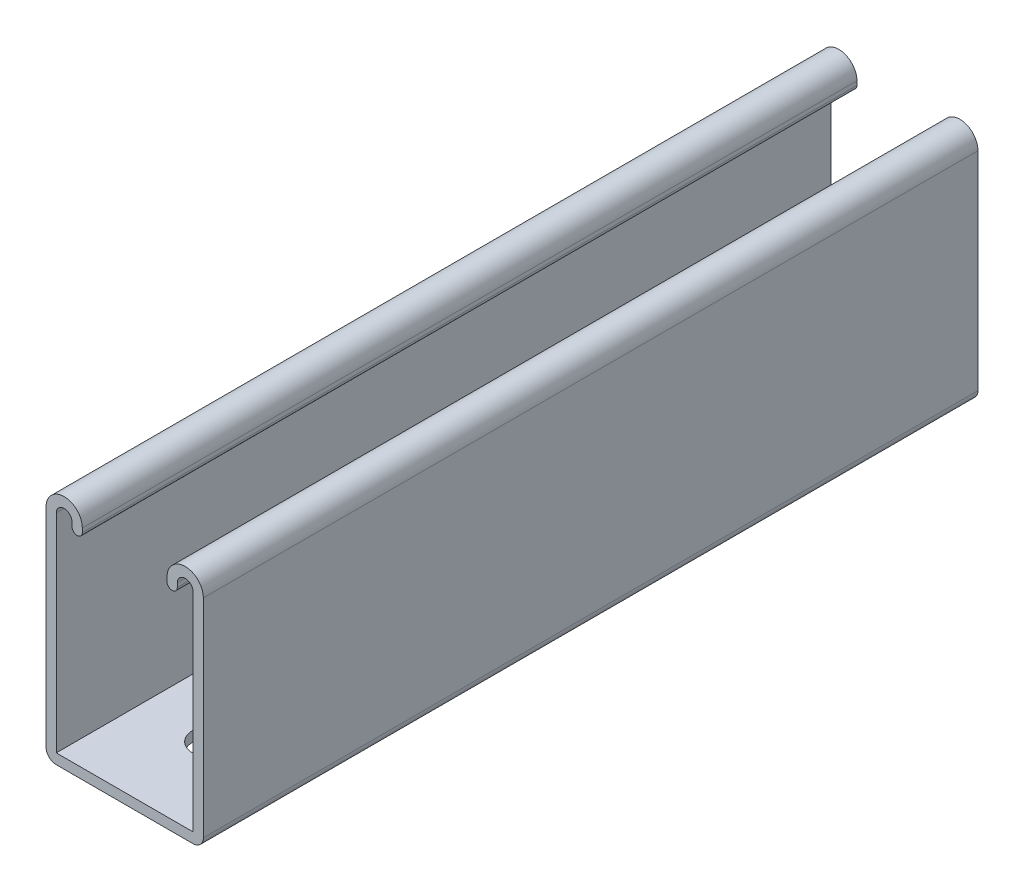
ISO-10303-21;
HEADER;
FILE_DESCRIPTION(('STEP AP214'),'2;1');
FILE_NAME('part.step','',(''),(''),'','','');
FILE_SCHEMA(('AUTOMOTIVE_DESIGN { 1 0 10303 214 1 1 1 1 }'));
ENDSEC;
DATA;
#1=APPLICATION_CONTEXT('core data for automotive mechanical design processes');
#2=APPLICATION_PROTOCOL_DEFINITION('international standard','automotive_design',2000,#1);
#3=PRODUCT_CONTEXT('',#1,'mechanical');
#4=PRODUCT('Part','Part','',(#3));
#5=PRODUCT_RELATED_PRODUCT_CATEGORY('part','',(#4));
#6=PRODUCT_DEFINITION_FORMATION('','',#4);
#7=PRODUCT_DEFINITION_CONTEXT('part definition',#1,'design');
#8=PRODUCT_DEFINITION('design','',#6,#7);
#9=PRODUCT_DEFINITION_SHAPE('','',#8);
#10=(LENGTH_UNIT() NAMED_UNIT(*) SI_UNIT(.MILLI.,.METRE.));
#11=(NAMED_UNIT(*) PLANE_ANGLE_UNIT() SI_UNIT($,.RADIAN.));
#12=(NAMED_UNIT(*) SI_UNIT($,.STERADIAN.) SOLID_ANGLE_UNIT());
#13=UNCERTAINTY_MEASURE_WITH_UNIT(LENGTH_MEASURE(1.E-05),#10,'distance_accuracy_value','');
#14=(GEOMETRIC_REPRESENTATION_CONTEXT(3) GLOBAL_UNCERTAINTY_ASSIGNED_CONTEXT((#13)) GLOBAL_UNIT_ASSIGNED_CONTEXT((#10,
#11,#12)) REPRESENTATION_CONTEXT('',''));
#15=CARTESIAN_POINT('',(0.,0.,0.));
#16=DIRECTION('',(0.,0.,1.));
#17=DIRECTION('',(1.,0.,0.));
#18=AXIS2_PLACEMENT_3D('',#15,#16,#17);
#19=CARTESIAN_POINT('',(-15.875,29.1719,203.2));
#20=DIRECTION('',(0.,0.,-1.));
#21=DIRECTION('',(-1.,0.,0.));
#22=AXIS2_PLACEMENT_3D('',#19,#20,#21);
#23=CYLINDRICAL_SURFACE('',#22,4.7625);
#24=CARTESIAN_POINT('',(-15.875,29.1719,0.));
#25=DIRECTION('',(0.,0.,1.));
#26=DIRECTION('',(-1.,0.,0.));
#27=AXIS2_PLACEMENT_3D('',#24,#25,#26);
#28=CIRCLE('',#27,4.7625);
#29=CARTESIAN_POINT('',(-11.1125,29.1719,0.));
#30=VERTEX_POINT('',#29);
#31=CARTESIAN_POINT('',(-20.6375,29.1719,0.));
#32=VERTEX_POINT('',#31);
#33=EDGE_CURVE('E278',#30,#32,#28,.T.);
#34=ORIENTED_EDGE('',*,*,#33,.T.);
#35=DIRECTION('',(0.,0.,-1.));
#36=VECTOR('',#35,1.);
#37=CARTESIAN_POINT('',(-20.6375,29.1719,203.2));
#38=LINE('',#37,#36);
#39=CARTESIAN_POINT('',(-20.6375,29.1719,203.2));
#40=VERTEX_POINT('',#39);
#41=EDGE_CURVE('E467',#40,#32,#38,.T.);
#42=ORIENTED_EDGE('',*,*,#41,.F.);
#43=CARTESIAN_POINT('',(-15.875,29.1719,203.2));
#44=DIRECTION('',(0.,0.,1.));
#45=DIRECTION('',(-1.,0.,0.));
#46=AXIS2_PLACEMENT_3D('',#43,#44,#45);
#47=CIRCLE('',#46,4.7625);
#48=CARTESIAN_POINT('',(-11.1125,29.1719,203.2));
#49=VERTEX_POINT('',#48);
#50=EDGE_CURVE('E286',#49,#40,#47,.T.);
#51=ORIENTED_EDGE('',*,*,#50,.F.);
#52=DIRECTION('',(0.,0.,-1.));
#53=VECTOR('',#52,1.);
#54=CARTESIAN_POINT('',(-11.1125,29.1719,203.2));
#55=LINE('',#54,#53);
#56=EDGE_CURVE('E344',#49,#30,#55,.T.);
#57=ORIENTED_EDGE('',*,*,#56,.T.);
#58=EDGE_LOOP('',(#34,#42,#51,#57));
#59=FACE_BOUND('',#58,.T.);
#60=ADVANCED_FACE('F41',(#59),#23,.T.);
#61=CARTESIAN_POINT('',(-20.6375,29.1719,203.2));
#62=DIRECTION('',(1.,0.,0.));
#63=DIRECTION('',(0.,1.,0.));
#64=AXIS2_PLACEMENT_3D('',#61,#62,#63);
#65=PLANE('',#64);
#66=DIRECTION('',(0.,-1.,0.));
#67=VECTOR('',#66,1.);
#68=CARTESIAN_POINT('',(-20.6375,29.1719,0.));
#69=LINE('',#68,#67);
#70=CARTESIAN_POINT('',(-20.6375,-25.3238,0.));
#71=VERTEX_POINT('',#70);
#72=EDGE_CURVE('E347',#32,#71,#69,.T.);
#73=ORIENTED_EDGE('',*,*,#72,.T.);
#74=DIRECTION('',(0.,0.,-1.));
#75=VECTOR('',#74,1.);
#76=CARTESIAN_POINT('',(-20.6375,-25.3238,203.2));
#77=LINE('',#76,#75);
#78=CARTESIAN_POINT('',(-20.6375,-25.3238,203.2));
#79=VERTEX_POINT('',#78);
#80=EDGE_CURVE('E464',#79,#71,#77,.T.);
#81=ORIENTED_EDGE('',*,*,#80,.F.);
#82=DIRECTION('',(0.,-1.,0.));
#83=VECTOR('',#82,1.);
#84=CARTESIAN_POINT('',(-20.6375,29.1719,203.2));
#85=LINE('',#84,#83);
#86=EDGE_CURVE('E291',#40,#79,#85,.T.);
#87=ORIENTED_EDGE('',*,*,#86,.F.);
#88=ORIENTED_EDGE('',*,*,#41,.T.);
#89=EDGE_LOOP('',(#73,#81,#87,#88));
#90=FACE_BOUND('',#89,.T.);
#91=ADVANCED_FACE('F514',(#90),#65,.F.);
#92=CARTESIAN_POINT('',(-17.9451,-25.3238,203.2));
#93=DIRECTION('',(0.,0.,-1.));
#94=DIRECTION('',(-1.,0.,0.));
#95=AXIS2_PLACEMENT_3D('',#92,#93,#94);
#96=CYLINDRICAL_SURFACE('',#95,2.6924);
#97=CARTESIAN_POINT('',(-17.9451,-25.3238,0.));
#98=DIRECTION('',(0.,0.,1.));
#99=DIRECTION('',(-1.,0.,0.));
#100=AXIS2_PLACEMENT_3D('',#97,#98,#99);
#101=CIRCLE('',#100,2.6924);
#102=CARTESIAN_POINT('',(-17.9451,-28.0162,0.));
#103=VERTEX_POINT('',#102);
#104=EDGE_CURVE('E354',#71,#103,#101,.T.);
#105=ORIENTED_EDGE('',*,*,#104,.T.);
#106=DIRECTION('',(0.,0.,-1.));
#107=VECTOR('',#106,1.);
#108=CARTESIAN_POINT('',(-17.9451,-28.0162,203.2));
#109=LINE('',#108,#107);
#110=CARTESIAN_POINT('',(-17.9451,-28.0162,203.2));
#111=VERTEX_POINT('',#110);
#112=EDGE_CURVE('E456',#111,#103,#109,.T.);
#113=ORIENTED_EDGE('',*,*,#112,.F.);
#114=CARTESIAN_POINT('',(-17.9451,-25.3238,203.2));
#115=DIRECTION('',(0.,0.,1.));
#116=DIRECTION('',(-1.,0.,0.));
#117=AXIS2_PLACEMENT_3D('',#114,#115,#116);
#118=CIRCLE('',#117,2.6924);
#119=EDGE_CURVE('E300',#79,#111,#118,.T.);
#120=ORIENTED_EDGE('',*,*,#119,.F.);
#121=ORIENTED_EDGE('',*,*,#80,.T.);
#122=EDGE_LOOP('',(#105,#113,#120,#121));
#123=FACE_BOUND('',#122,.T.);
#124=ADVANCED_FACE('F517',(#123),#96,.T.);
#125=CARTESIAN_POINT('',(-17.9451,-28.0162,203.2));
#126=DIRECTION('',(0.,1.,0.));
#127=DIRECTION('',(-1.,0.,0.));
#128=AXIS2_PLACEMENT_3D('',#125,#126,#127);
#129=PLANE('',#128);
#130=DIRECTION('',(0.,0.,-1.));
#131=VECTOR('',#130,1.);
#132=CARTESIAN_POINT('',(-5.159375,-28.0162000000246,114.3));
#133=LINE('',#132,#131);
#134=CARTESIAN_POINT('',(-5.159375,-28.0162,180.18125));
#135=VERTEX_POINT('',#134);
#136=CARTESIAN_POINT('',(-5.159375,-28.0162000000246,114.3));
#137=VERTEX_POINT('',#136);
#138=EDGE_CURVE('E218',#135,#137,#133,.T.);
#139=ORIENTED_EDGE('',*,*,#138,.F.);
#140=CARTESIAN_POINT('',(0.,-28.0162000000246,180.18125));
#141=DIRECTION('',(0.,-1.,0.));
#142=DIRECTION('',(1.,0.,0.));
#143=AXIS2_PLACEMENT_3D('',#140,#141,#142);
#144=CIRCLE('',#143,5.159375);
#145=CARTESIAN_POINT('',(5.159375,-28.0162000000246,180.18125));
#146=VERTEX_POINT('',#145);
#147=EDGE_CURVE('E57',#146,#135,#144,.T.);
#148=ORIENTED_EDGE('',*,*,#147,.F.);
#149=DIRECTION('',(0.,0.,1.));
#150=VECTOR('',#149,1.);
#151=CARTESIAN_POINT('',(5.159375,-28.0162000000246,180.18125));
#152=LINE('',#151,#150);
#153=CARTESIAN_POINT('',(5.15937500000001,-28.0162000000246,114.3));
#154=VERTEX_POINT('',#153);
#155=EDGE_CURVE('E234',#154,#146,#152,.T.);
#156=ORIENTED_EDGE('',*,*,#155,.F.);
#157=CARTESIAN_POINT('',(0.,-28.0162000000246,114.3));
#158=DIRECTION('',(0.,-1.,0.));
#159=DIRECTION('',(1.,0.,0.));
#160=AXIS2_PLACEMENT_3D('',#157,#158,#159);
#161=CIRCLE('',#160,5.159375);
#162=EDGE_CURVE('E227',#137,#154,#161,.T.);
#163=ORIENTED_EDGE('',*,*,#162,.F.);
#164=EDGE_LOOP('',(#139,#148,#156,#163));
#165=FACE_BOUND('',#164,.T.);
#166=DIRECTION('',(0.,0.,-1.));
#167=VECTOR('',#166,1.);
#168=CARTESIAN_POINT('',(-5.159375,-28.0162000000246,12.7));
#169=LINE('',#168,#167);
#170=CARTESIAN_POINT('',(-5.15937500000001,-28.0162,78.58125));
#171=VERTEX_POINT('',#170);
#172=CARTESIAN_POINT('',(-5.159375,-28.0162000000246,12.7));
#173=VERTEX_POINT('',#172);
#174=EDGE_CURVE('E261',#171,#173,#169,.T.);
#175=ORIENTED_EDGE('',*,*,#174,.F.);
#176=CARTESIAN_POINT('',(0.,-28.0162000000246,78.58125));
#177=DIRECTION('',(0.,-1.,0.));
#178=DIRECTION('',(1.,0.,0.));
#179=AXIS2_PLACEMENT_3D('',#176,#177,#178);
#180=CIRCLE('',#179,5.159375);
#181=CARTESIAN_POINT('',(5.159375,-28.0162000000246,78.58125));
#182=VERTEX_POINT('',#181);
#183=EDGE_CURVE('E259',#182,#171,#180,.T.);
#184=ORIENTED_EDGE('',*,*,#183,.F.);
#185=DIRECTION('',(0.,0.,1.));
#186=VECTOR('',#185,1.);
#187=CARTESIAN_POINT('',(5.159375,-28.0162000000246,78.58125));
#188=LINE('',#187,#186);
#189=CARTESIAN_POINT('',(5.15937500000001,-28.0162000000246,12.7));
#190=VERTEX_POINT('',#189);
#191=EDGE_CURVE('E272',#190,#182,#188,.T.);
#192=ORIENTED_EDGE('',*,*,#191,.F.);
#193=CARTESIAN_POINT('',(0.,-28.0162000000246,12.7));
#194=DIRECTION('',(0.,-1.,0.));
#195=DIRECTION('',(1.,0.,0.));
#196=AXIS2_PLACEMENT_3D('',#193,#194,#195);
#197=CIRCLE('',#196,5.159375);
#198=EDGE_CURVE('E269',#173,#190,#197,.T.);
#199=ORIENTED_EDGE('',*,*,#198,.F.);
#200=EDGE_LOOP('',(#175,#184,#192,#199));
#201=FACE_BOUND('',#200,.T.);
#202=DIRECTION('',(1.,0.,0.));
#203=VECTOR('',#202,1.);
#204=CARTESIAN_POINT('',(-17.9451,-28.0162,0.));
#205=LINE('',#204,#203);
#206=CARTESIAN_POINT('',(17.9451,-28.0162,0.));
#207=VERTEX_POINT('',#206);
#208=EDGE_CURVE('E353',#103,#207,#205,.T.);
#209=ORIENTED_EDGE('',*,*,#208,.T.);
#210=DIRECTION('',(0.,0.,-1.));
#211=VECTOR('',#210,1.);
#212=CARTESIAN_POINT('',(17.9451,-28.0162,203.2));
#213=LINE('',#212,#211);
#214=CARTESIAN_POINT('',(17.9451,-28.0162,203.2));
#215=VERTEX_POINT('',#214);
#216=EDGE_CURVE('E453',#215,#207,#213,.T.);
#217=ORIENTED_EDGE('',*,*,#216,.F.);
#218=DIRECTION('',(1.,0.,0.));
#219=VECTOR('',#218,1.);
#220=CARTESIAN_POINT('',(-17.9451,-28.0162,203.2));
#221=LINE('',#220,#219);
#222=EDGE_CURVE('E297',#111,#215,#221,.T.);
#223=ORIENTED_EDGE('',*,*,#222,.F.);
#224=ORIENTED_EDGE('',*,*,#112,.T.);
#225=EDGE_LOOP('',(#209,#217,#223,#224));
#226=FACE_BOUND('',#225,.T.);
#227=ADVANCED_FACE('F235',(#165,#201,#226),#129,.F.);
#228=CARTESIAN_POINT('',(17.9451,-25.3238,203.2));
#229=DIRECTION('',(0.,0.,-1.));
#230=DIRECTION('',(-1.,0.,0.));
#231=AXIS2_PLACEMENT_3D('',#228,#229,#230);
#232=CYLINDRICAL_SURFACE('',#231,2.6924);
#233=CARTESIAN_POINT('',(17.9451,-25.3238,0.));
#234=DIRECTION('',(0.,0.,1.));
#235=DIRECTION('',(1.,0.,0.));
#236=AXIS2_PLACEMENT_3D('',#233,#234,#235);
#237=CIRCLE('',#236,2.6924);
#238=CARTESIAN_POINT('',(20.6375,-25.3238,0.));
#239=VERTEX_POINT('',#238);
#240=EDGE_CURVE('E356',#207,#239,#237,.T.);
#241=ORIENTED_EDGE('',*,*,#240,.T.);
#242=DIRECTION('',(0.,0.,-1.));
#243=VECTOR('',#242,1.);
#244=CARTESIAN_POINT('',(20.6375,-25.3238,203.2));
#245=LINE('',#244,#243);
#246=CARTESIAN_POINT('',(20.6375,-25.3238,203.2));
#247=VERTEX_POINT('',#246);
#248=EDGE_CURVE('E448',#247,#239,#245,.T.);
#249=ORIENTED_EDGE('',*,*,#248,.F.);
#250=CARTESIAN_POINT('',(17.9451,-25.3238,203.2));
#251=DIRECTION('',(0.,0.,1.));
#252=DIRECTION('',(1.,0.,0.));
#253=AXIS2_PLACEMENT_3D('',#250,#251,#252);
#254=CIRCLE('',#253,2.6924);
#255=EDGE_CURVE('E303',#215,#247,#254,.T.);
#256=ORIENTED_EDGE('',*,*,#255,.F.);
#257=ORIENTED_EDGE('',*,*,#216,.T.);
#258=EDGE_LOOP('',(#241,#249,#256,#257));
#259=FACE_BOUND('',#258,.T.);
#260=ADVANCED_FACE('F596',(#259),#232,.T.);
#261=CARTESIAN_POINT('',(20.6375,-25.3238,203.2));
#262=DIRECTION('',(-1.,0.,0.));
#263=DIRECTION('',(0.,-1.,0.));
#264=AXIS2_PLACEMENT_3D('',#261,#262,#263);
#265=PLANE('',#264);
#266=DIRECTION('',(0.,1.,0.));
#267=VECTOR('',#266,1.);
#268=CARTESIAN_POINT('',(20.6375,-25.3238,0.));
#269=LINE('',#268,#267);
#270=CARTESIAN_POINT('',(20.6375,29.1719,0.));
#271=VERTEX_POINT('',#270);
#272=EDGE_CURVE('E363',#239,#271,#269,.T.);
#273=ORIENTED_EDGE('',*,*,#272,.T.);
#274=DIRECTION('',(0.,0.,-1.));
#275=VECTOR('',#274,1.);
#276=CARTESIAN_POINT('',(20.6375,29.1719,203.2));
#277=LINE('',#276,#275);
#278=CARTESIAN_POINT('',(20.6375,29.1719,203.2));
#279=VERTEX_POINT('',#278);
#280=EDGE_CURVE('E447',#279,#271,#277,.T.);
#281=ORIENTED_EDGE('',*,*,#280,.F.);
#282=DIRECTION('',(0.,1.,0.));
#283=VECTOR('',#282,1.);
#284=CARTESIAN_POINT('',(20.6375,-25.3238,203.2));
#285=LINE('',#284,#283);
#286=EDGE_CURVE('E306',#247,#279,#285,.T.);
#287=ORIENTED_EDGE('',*,*,#286,.F.);
#288=ORIENTED_EDGE('',*,*,#248,.T.);
#289=EDGE_LOOP('',(#273,#281,#287,#288));
#290=FACE_BOUND('',#289,.T.);
#291=ADVANCED_FACE('F591',(#290),#265,.F.);
#292=CARTESIAN_POINT('',(15.875,29.1719,203.2));
#293=DIRECTION('',(0.,0.,-1.));
#294=DIRECTION('',(-1.,0.,0.));
#295=AXIS2_PLACEMENT_3D('',#292,#293,#294);
#296=CYLINDRICAL_SURFACE('',#295,4.7625);
#297=CARTESIAN_POINT('',(15.875,29.1719,0.));
#298=DIRECTION('',(0.,0.,1.));
#299=DIRECTION('',(1.,0.,0.));
#300=AXIS2_PLACEMENT_3D('',#297,#298,#299);
#301=CIRCLE('',#300,4.7625);
#302=CARTESIAN_POINT('',(11.1125,29.1719,0.));
#303=VERTEX_POINT('',#302);
#304=EDGE_CURVE('E364',#271,#303,#301,.T.);
#305=ORIENTED_EDGE('',*,*,#304,.T.);
#306=DIRECTION('',(0.,0.,-1.));
#307=VECTOR('',#306,1.);
#308=CARTESIAN_POINT('',(11.1125,29.1719,203.2));
#309=LINE('',#308,#307);
#310=CARTESIAN_POINT('',(11.1125,29.1719,203.2));
#311=VERTEX_POINT('',#310);
#312=EDGE_CURVE('E445',#311,#303,#309,.T.);
#313=ORIENTED_EDGE('',*,*,#312,.F.);
#314=CARTESIAN_POINT('',(15.875,29.1719,203.2));
#315=DIRECTION('',(0.,0.,1.));
#316=DIRECTION('',(1.,0.,0.));
#317=AXIS2_PLACEMENT_3D('',#314,#315,#316);
#318=CIRCLE('',#317,4.7625);
#319=EDGE_CURVE('E307',#279,#311,#318,.T.);
#320=ORIENTED_EDGE('',*,*,#319,.F.);
#321=ORIENTED_EDGE('',*,*,#280,.T.);
#322=EDGE_LOOP('',(#305,#313,#320,#321));
#323=FACE_BOUND('',#322,.T.);
#324=ADVANCED_FACE('F587',(#323),#296,.T.);
#325=CARTESIAN_POINT('',(11.1125,29.1719,203.2));
#326=DIRECTION('',(1.,0.,0.));
#327=DIRECTION('',(0.,1.,0.));
#328=AXIS2_PLACEMENT_3D('',#325,#326,#327);
#329=PLANE('',#328);
#330=DIRECTION('',(0.,-1.,0.));
#331=VECTOR('',#330,1.);
#332=CARTESIAN_POINT('',(11.1125,29.1719,0.));
#333=LINE('',#332,#331);
#334=CARTESIAN_POINT('',(11.1125,28.13685,0.));
#335=VERTEX_POINT('',#334);
#336=EDGE_CURVE('E370',#303,#335,#333,.T.);
#337=ORIENTED_EDGE('',*,*,#336,.T.);
#338=DIRECTION('',(0.,0.,-1.));
#339=VECTOR('',#338,1.);
#340=CARTESIAN_POINT('',(11.1125,28.13685,203.2));
#341=LINE('',#340,#339);
#342=CARTESIAN_POINT('',(11.1125,28.13685,203.2));
#343=VERTEX_POINT('',#342);
#344=EDGE_CURVE('E438',#343,#335,#341,.T.);
#345=ORIENTED_EDGE('',*,*,#344,.F.);
#346=DIRECTION('',(0.,-1.,0.));
#347=VECTOR('',#346,1.);
#348=CARTESIAN_POINT('',(11.1125,29.1719,203.2));
#349=LINE('',#348,#347);
#350=EDGE_CURVE('E315',#311,#343,#349,.T.);
#351=ORIENTED_EDGE('',*,*,#350,.F.);
#352=ORIENTED_EDGE('',*,*,#312,.T.);
#353=EDGE_LOOP('',(#337,#345,#351,#352));
#354=FACE_BOUND('',#353,.T.);
#355=ADVANCED_FACE('F582',(#354),#329,.F.);
#356=CARTESIAN_POINT('',(12.4587,28.13685,203.2));
#357=DIRECTION('',(0.,0.,-1.));
#358=DIRECTION('',(-1.,0.,0.));
#359=AXIS2_PLACEMENT_3D('',#356,#357,#358);
#360=CYLINDRICAL_SURFACE('',#359,1.3462);
#361=CARTESIAN_POINT('',(12.4587,28.13685,0.));
#362=DIRECTION('',(0.,0.,1.));
#363=DIRECTION('',(1.,0.,0.));
#364=AXIS2_PLACEMENT_3D('',#361,#362,#363);
#365=CIRCLE('',#364,1.3462);
#366=CARTESIAN_POINT('',(13.8049,28.13685,0.));
#367=VERTEX_POINT('',#366);
#368=EDGE_CURVE('E369',#335,#367,#365,.T.);
#369=ORIENTED_EDGE('',*,*,#368,.T.);
#370=DIRECTION('',(0.,0.,-1.));
#371=VECTOR('',#370,1.);
#372=CARTESIAN_POINT('',(13.8049,28.13685,203.2));
#373=LINE('',#372,#371);
#374=CARTESIAN_POINT('',(13.8049,28.13685,203.2));
#375=VERTEX_POINT('',#374);
#376=EDGE_CURVE('E432',#375,#367,#373,.T.);
#377=ORIENTED_EDGE('',*,*,#376,.F.);
#378=CARTESIAN_POINT('',(12.4587,28.13685,203.2));
#379=DIRECTION('',(0.,0.,1.));
#380=DIRECTION('',(1.,0.,0.));
#381=AXIS2_PLACEMENT_3D('',#378,#379,#380);
#382=CIRCLE('',#381,1.3462);
#383=EDGE_CURVE('E314',#343,#375,#382,.T.);
#384=ORIENTED_EDGE('',*,*,#383,.F.);
#385=ORIENTED_EDGE('',*,*,#344,.T.);
#386=EDGE_LOOP('',(#369,#377,#384,#385));
#387=FACE_BOUND('',#386,.T.);
#388=ADVANCED_FACE('F576',(#387),#360,.T.);
#389=CARTESIAN_POINT('',(13.8049,29.1719,203.2));
#390=DIRECTION('',(-1.,0.,0.));
#391=DIRECTION('',(0.,0.,1.));
#392=AXIS2_PLACEMENT_3D('',#389,#390,#391);
#393=PLANE('',#392);
#394=DIRECTION('',(0.,1.,0.));
#395=VECTOR('',#394,1.);
#396=CARTESIAN_POINT('',(13.8049,29.1719,0.));
#397=LINE('',#396,#395);
#398=CARTESIAN_POINT('',(13.8049,29.1719,0.));
#399=VERTEX_POINT('',#398);
#400=EDGE_CURVE('E373',#367,#399,#397,.T.);
#401=ORIENTED_EDGE('',*,*,#400,.T.);
#402=DIRECTION('',(0.,0.,-1.));
#403=VECTOR('',#402,1.);
#404=CARTESIAN_POINT('',(13.8049,29.1719,203.2));
#405=LINE('',#404,#403);
#406=CARTESIAN_POINT('',(13.8049,29.1719,203.2));
#407=VERTEX_POINT('',#406);
#408=EDGE_CURVE('E427',#407,#399,#405,.T.);
#409=ORIENTED_EDGE('',*,*,#408,.F.);
#410=DIRECTION('',(0.,1.,0.));
#411=VECTOR('',#410,1.);
#412=CARTESIAN_POINT('',(13.8049,29.1719,203.2));
#413=LINE('',#412,#411);
#414=EDGE_CURVE('E319',#375,#407,#413,.T.);
#415=ORIENTED_EDGE('',*,*,#414,.F.);
#416=ORIENTED_EDGE('',*,*,#376,.T.);
#417=EDGE_LOOP('',(#401,#409,#415,#416));
#418=FACE_BOUND('',#417,.T.);
#419=ADVANCED_FACE('F573',(#418),#393,.F.);
#420=CARTESIAN_POINT('',(15.875,29.1719,203.2));
#421=DIRECTION('',(0.,0.,-1.));
#422=DIRECTION('',(-1.,0.,0.));
#423=AXIS2_PLACEMENT_3D('',#420,#421,#422);
#424=CYLINDRICAL_SURFACE('',#423,2.0701);
#425=CARTESIAN_POINT('',(15.875,29.1719,0.));
#426=DIRECTION('',(0.,0.,-1.));
#427=DIRECTION('',(1.,0.,0.));
#428=AXIS2_PLACEMENT_3D('',#425,#426,#427);
#429=CIRCLE('',#428,2.0701);
#430=CARTESIAN_POINT('',(17.9451,29.1719,0.));
#431=VERTEX_POINT('',#430);
#432=EDGE_CURVE('E376',#399,#431,#429,.T.);
#433=ORIENTED_EDGE('',*,*,#432,.T.);
#434=DIRECTION('',(0.,0.,-1.));
#435=VECTOR('',#434,1.);
#436=CARTESIAN_POINT('',(17.9451,29.1719,203.2));
#437=LINE('',#436,#435);
#438=CARTESIAN_POINT('',(17.9451,29.1719,203.2));
#439=VERTEX_POINT('',#438);
#440=EDGE_CURVE('E428',#439,#431,#437,.T.);
#441=ORIENTED_EDGE('',*,*,#440,.F.);
#442=CARTESIAN_POINT('',(15.875,29.1719,203.2));
#443=DIRECTION('',(0.,0.,-1.));
#444=DIRECTION('',(1.,0.,0.));
#445=AXIS2_PLACEMENT_3D('',#442,#443,#444);
#446=CIRCLE('',#445,2.0701);
#447=EDGE_CURVE('E321',#407,#439,#446,.T.);
#448=ORIENTED_EDGE('',*,*,#447,.F.);
#449=ORIENTED_EDGE('',*,*,#408,.T.);
#450=EDGE_LOOP('',(#433,#441,#448,#449));
#451=FACE_BOUND('',#450,.T.);
#452=ADVANCED_FACE('F568',(#451),#424,.F.);
#453=CARTESIAN_POINT('',(17.9451,-25.3238,203.2));
#454=DIRECTION('',(1.,0.,0.));
#455=DIRECTION('',(0.,0.,-1.));
#456=AXIS2_PLACEMENT_3D('',#453,#454,#455);
#457=PLANE('',#456);
#458=DIRECTION('',(0.,-1.,0.));
#459=VECTOR('',#458,1.);
#460=CARTESIAN_POINT('',(17.9451,-25.3238,0.));
#461=LINE('',#460,#459);
#462=CARTESIAN_POINT('',(17.9451,-25.3238,0.));
#463=VERTEX_POINT('',#462);
#464=EDGE_CURVE('E378',#431,#463,#461,.T.);
#465=ORIENTED_EDGE('',*,*,#464,.T.);
#466=DIRECTION('',(0.,0.,-1.));
#467=VECTOR('',#466,1.);
#468=CARTESIAN_POINT('',(17.9451,-25.3238,203.2));
#469=LINE('',#468,#467);
#470=CARTESIAN_POINT('',(17.9451,-25.3238,203.2));
#471=VERTEX_POINT('',#470);
#472=EDGE_CURVE('E422',#471,#463,#469,.T.);
#473=ORIENTED_EDGE('',*,*,#472,.F.);
#474=DIRECTION('',(0.,-1.,0.));
#475=VECTOR('',#474,1.);
#476=CARTESIAN_POINT('',(17.9451,-25.3238,203.2));
#477=LINE('',#476,#475);
#478=EDGE_CURVE('E323',#439,#471,#477,.T.);
#479=ORIENTED_EDGE('',*,*,#478,.F.);
#480=ORIENTED_EDGE('',*,*,#440,.T.);
#481=EDGE_LOOP('',(#465,#473,#479,#480));
#482=FACE_BOUND('',#481,.T.);
#483=ADVANCED_FACE('F562',(#482),#457,.F.);
#484=CARTESIAN_POINT('',(-17.9451,-25.3238,203.2));
#485=DIRECTION('',(0.,-1.,0.));
#486=DIRECTION('',(0.,0.,-1.));
#487=AXIS2_PLACEMENT_3D('',#484,#485,#486);
#488=PLANE('',#487);
#489=DIRECTION('',(0.,0.,1.));
#490=VECTOR('',#489,1.);
#491=CARTESIAN_POINT('',(5.159375,-25.3238,304.8));
#492=LINE('',#491,#490);
#493=CARTESIAN_POINT('',(5.15937500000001,-25.3238,114.3));
#494=VERTEX_POINT('',#493);
#495=CARTESIAN_POINT('',(5.159375,-25.3238,180.18125));
#496=VERTEX_POINT('',#495);
#497=EDGE_CURVE('E249',#494,#496,#492,.T.);
#498=ORIENTED_EDGE('',*,*,#497,.T.);
#499=CARTESIAN_POINT('',(0.,-25.3238,180.18125));
#500=DIRECTION('',(0.,-1.,0.));
#501=DIRECTION('',(0.,0.,-1.));
#502=AXIS2_PLACEMENT_3D('',#499,#500,#501);
#503=CIRCLE('',#502,5.159375);
#504=CARTESIAN_POINT('',(-5.159375,-25.3238,180.18125));
#505=VERTEX_POINT('',#504);
#506=EDGE_CURVE('E256',#496,#505,#503,.T.);
#507=ORIENTED_EDGE('',*,*,#506,.T.);
#508=DIRECTION('',(0.,0.,-1.));
#509=VECTOR('',#508,1.);
#510=CARTESIAN_POINT('',(-5.15937500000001,-25.3238,304.8));
#511=LINE('',#510,#509);
#512=CARTESIAN_POINT('',(-5.159375,-25.3238,114.3));
#513=VERTEX_POINT('',#512);
#514=EDGE_CURVE('E221',#505,#513,#511,.T.);
#515=ORIENTED_EDGE('',*,*,#514,.T.);
#516=CARTESIAN_POINT('',(0.,-25.3238,114.3));
#517=DIRECTION('',(0.,-1.,0.));
#518=DIRECTION('',(0.,0.,-1.));
#519=AXIS2_PLACEMENT_3D('',#516,#517,#518);
#520=CIRCLE('',#519,5.159375);
#521=EDGE_CURVE('E63',#513,#494,#520,.T.);
#522=ORIENTED_EDGE('',*,*,#521,.T.);
#523=EDGE_LOOP('',(#498,#507,#515,#522));
#524=FACE_BOUND('',#523,.T.);
#525=DIRECTION('',(0.,0.,1.));
#526=VECTOR('',#525,1.);
#527=CARTESIAN_POINT('',(5.159375,-25.3238,203.2));
#528=LINE('',#527,#526);
#529=CARTESIAN_POINT('',(5.15937500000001,-25.3238,12.7));
#530=VERTEX_POINT('',#529);
#531=CARTESIAN_POINT('',(5.159375,-25.3238,78.58125));
#532=VERTEX_POINT('',#531);
#533=EDGE_CURVE('E47',#530,#532,#528,.T.);
#534=ORIENTED_EDGE('',*,*,#533,.T.);
#535=CARTESIAN_POINT('',(0.,-25.3238,78.58125));
#536=DIRECTION('',(0.,-1.,0.));
#537=DIRECTION('',(0.,0.,-1.));
#538=AXIS2_PLACEMENT_3D('',#535,#536,#537);
#539=CIRCLE('',#538,5.159375);
#540=CARTESIAN_POINT('',(-5.159375,-25.3238,78.58125));
#541=VERTEX_POINT('',#540);
#542=EDGE_CURVE('E11',#532,#541,#539,.T.);
#543=ORIENTED_EDGE('',*,*,#542,.T.);
#544=DIRECTION('',(0.,0.,-1.));
#545=VECTOR('',#544,1.);
#546=CARTESIAN_POINT('',(-5.15937500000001,-25.3238,203.2));
#547=LINE('',#546,#545);
#548=CARTESIAN_POINT('',(-5.159375,-25.3238,12.7));
#549=VERTEX_POINT('',#548);
#550=EDGE_CURVE('E468',#541,#549,#547,.T.);
#551=ORIENTED_EDGE('',*,*,#550,.T.);
#552=CARTESIAN_POINT('',(0.,-25.3238,12.7));
#553=DIRECTION('',(0.,-1.,0.));
#554=DIRECTION('',(0.,0.,-1.));
#555=AXIS2_PLACEMENT_3D('',#552,#553,#554);
#556=CIRCLE('',#555,5.159375);
#557=EDGE_CURVE('E473',#549,#530,#556,.T.);
#558=ORIENTED_EDGE('',*,*,#557,.T.);
#559=EDGE_LOOP('',(#534,#543,#551,#558));
#560=FACE_BOUND('',#559,.T.);
#561=DIRECTION('',(-1.,0.,0.));
#562=VECTOR('',#561,1.);
#563=CARTESIAN_POINT('',(-17.9451,-25.3238,0.));
#564=LINE('',#563,#562);
#565=CARTESIAN_POINT('',(-17.9451,-25.3238,0.));
#566=VERTEX_POINT('',#565);
#567=EDGE_CURVE('E385',#463,#566,#564,.T.);
#568=ORIENTED_EDGE('',*,*,#567,.T.);
#569=DIRECTION('',(0.,0.,-1.));
#570=VECTOR('',#569,1.);
#571=CARTESIAN_POINT('',(-17.9451,-25.3238,203.2));
#572=LINE('',#571,#570);
#573=CARTESIAN_POINT('',(-17.9451,-25.3238,203.2));
#574=VERTEX_POINT('',#573);
#575=EDGE_CURVE('E420',#574,#566,#572,.T.);
#576=ORIENTED_EDGE('',*,*,#575,.F.);
#577=DIRECTION('',(-1.,0.,0.));
#578=VECTOR('',#577,1.);
#579=CARTESIAN_POINT('',(-17.9451,-25.3238,203.2));
#580=LINE('',#579,#578);
#581=EDGE_CURVE('E330',#471,#574,#580,.T.);
#582=ORIENTED_EDGE('',*,*,#581,.F.);
#583=ORIENTED_EDGE('',*,*,#472,.T.);
#584=EDGE_LOOP('',(#568,#576,#582,#583));
#585=FACE_BOUND('',#584,.T.);
#586=ADVANCED_FACE('F482',(#524,#560,#585),#488,.F.);
#587=CARTESIAN_POINT('',(-17.9451,29.1719,203.2));
#588=DIRECTION('',(-1.,0.,0.));
#589=DIRECTION('',(0.,-1.,0.));
#590=AXIS2_PLACEMENT_3D('',#587,#588,#589);
#591=PLANE('',#590);
#592=DIRECTION('',(0.,1.,0.));
#593=VECTOR('',#592,1.);
#594=CARTESIAN_POINT('',(-17.9451,29.1719,0.));
#595=LINE('',#594,#593);
#596=CARTESIAN_POINT('',(-17.9451,29.1719,0.));
#597=VERTEX_POINT('',#596);
#598=EDGE_CURVE('E383',#566,#597,#595,.T.);
#599=ORIENTED_EDGE('',*,*,#598,.T.);
#600=DIRECTION('',(0.,0.,-1.));
#601=VECTOR('',#600,1.);
#602=CARTESIAN_POINT('',(-17.9451,29.1719,203.2));
#603=LINE('',#602,#601);
#604=CARTESIAN_POINT('',(-17.9451,29.1719,203.2));
#605=VERTEX_POINT('',#604);
#606=EDGE_CURVE('E412',#605,#597,#603,.T.);
#607=ORIENTED_EDGE('',*,*,#606,.F.);
#608=DIRECTION('',(0.,1.,0.));
#609=VECTOR('',#608,1.);
#610=CARTESIAN_POINT('',(-17.9451,29.1719,203.2));
#611=LINE('',#610,#609);
#612=EDGE_CURVE('E329',#574,#605,#611,.T.);
#613=ORIENTED_EDGE('',*,*,#612,.F.);
#614=ORIENTED_EDGE('',*,*,#575,.T.);
#615=EDGE_LOOP('',(#599,#607,#613,#614));
#616=FACE_BOUND('',#615,.T.);
#617=ADVANCED_FACE('F554',(#616),#591,.F.);
#618=CARTESIAN_POINT('',(-15.875,29.1719,203.2));
#619=DIRECTION('',(0.,0.,-1.));
#620=DIRECTION('',(-1.,0.,0.));
#621=AXIS2_PLACEMENT_3D('',#618,#619,#620);
#622=CYLINDRICAL_SURFACE('',#621,2.0701);
#623=CARTESIAN_POINT('',(-15.875,29.1719,0.));
#624=DIRECTION('',(0.,0.,-1.));
#625=DIRECTION('',(-1.,0.,0.));
#626=AXIS2_PLACEMENT_3D('',#623,#624,#625);
#627=CIRCLE('',#626,2.0701);
#628=CARTESIAN_POINT('',(-13.8049,29.1719,0.));
#629=VERTEX_POINT('',#628);
#630=EDGE_CURVE('E387',#597,#629,#627,.T.);
#631=ORIENTED_EDGE('',*,*,#630,.T.);
#632=DIRECTION('',(0.,0.,-1.));
#633=VECTOR('',#632,1.);
#634=CARTESIAN_POINT('',(-13.8049,29.1719,203.2));
#635=LINE('',#634,#633);
#636=CARTESIAN_POINT('',(-13.8049,29.1719,203.2));
#637=VERTEX_POINT('',#636);
#638=EDGE_CURVE('E409',#637,#629,#635,.T.);
#639=ORIENTED_EDGE('',*,*,#638,.F.);
#640=CARTESIAN_POINT('',(-15.875,29.1719,203.2));
#641=DIRECTION('',(0.,0.,-1.));
#642=DIRECTION('',(-1.,0.,0.));
#643=AXIS2_PLACEMENT_3D('',#640,#641,#642);
#644=CIRCLE('',#643,2.0701);
#645=EDGE_CURVE('E335',#605,#637,#644,.T.);
#646=ORIENTED_EDGE('',*,*,#645,.F.);
#647=ORIENTED_EDGE('',*,*,#606,.T.);
#648=EDGE_LOOP('',(#631,#639,#646,#647));
#649=FACE_BOUND('',#648,.T.);
#650=ADVANCED_FACE('F553',(#649),#622,.F.);
#651=CARTESIAN_POINT('',(-13.8049,29.1719,203.2));
#652=DIRECTION('',(1.,0.,0.));
#653=DIRECTION('',(0.,0.,-1.));
#654=AXIS2_PLACEMENT_3D('',#651,#652,#653);
#655=PLANE('',#654);
#656=DIRECTION('',(0.,-1.,0.));
#657=VECTOR('',#656,1.);
#658=CARTESIAN_POINT('',(-13.8049,29.1719,0.));
#659=LINE('',#658,#657);
#660=CARTESIAN_POINT('',(-13.8049,28.13685,0.));
#661=VERTEX_POINT('',#660);
#662=EDGE_CURVE('E393',#629,#661,#659,.T.);
#663=ORIENTED_EDGE('',*,*,#662,.T.);
#664=DIRECTION('',(0.,0.,-1.));
#665=VECTOR('',#664,1.);
#666=CARTESIAN_POINT('',(-13.8049,28.13685,203.2));
#667=LINE('',#666,#665);
#668=CARTESIAN_POINT('',(-13.8049,28.13685,203.2));
#669=VERTEX_POINT('',#668);
#670=EDGE_CURVE('E406',#669,#661,#667,.T.);
#671=ORIENTED_EDGE('',*,*,#670,.F.);
#672=DIRECTION('',(0.,-1.,0.));
#673=VECTOR('',#672,1.);
#674=CARTESIAN_POINT('',(-13.8049,29.1719,203.2));
#675=LINE('',#674,#673);
#676=EDGE_CURVE('E337',#637,#669,#675,.T.);
#677=ORIENTED_EDGE('',*,*,#676,.F.);
#678=ORIENTED_EDGE('',*,*,#638,.T.);
#679=EDGE_LOOP('',(#663,#671,#677,#678));
#680=FACE_BOUND('',#679,.T.);
#681=ADVANCED_FACE('F547',(#680),#655,.F.);
#682=CARTESIAN_POINT('',(-12.4587,28.13685,203.2));
#683=DIRECTION('',(0.,0.,-1.));
#684=DIRECTION('',(-1.,0.,0.));
#685=AXIS2_PLACEMENT_3D('',#682,#683,#684);
#686=CYLINDRICAL_SURFACE('',#685,1.3462);
#687=CARTESIAN_POINT('',(-12.4587,28.13685,0.));
#688=DIRECTION('',(0.,0.,1.));
#689=DIRECTION('',(-1.,0.,0.));
#690=AXIS2_PLACEMENT_3D('',#687,#688,#689);
#691=CIRCLE('',#690,1.3462);
#692=CARTESIAN_POINT('',(-11.1125,28.13685,0.));
#693=VERTEX_POINT('',#692);
#694=EDGE_CURVE('E392',#661,#693,#691,.T.);
#695=ORIENTED_EDGE('',*,*,#694,.T.);
#696=DIRECTION('',(0.,0.,-1.));
#697=VECTOR('',#696,1.);
#698=CARTESIAN_POINT('',(-11.1125,28.13685,203.2));
#699=LINE('',#698,#697);
#700=CARTESIAN_POINT('',(-11.1125,28.13685,203.2));
#701=VERTEX_POINT('',#700);
#702=EDGE_CURVE('E405',#701,#693,#699,.T.);
#703=ORIENTED_EDGE('',*,*,#702,.F.);
#704=CARTESIAN_POINT('',(-12.4587,28.13685,203.2));
#705=DIRECTION('',(0.,0.,1.));
#706=DIRECTION('',(-1.,0.,0.));
#707=AXIS2_PLACEMENT_3D('',#704,#705,#706);
#708=CIRCLE('',#707,1.3462);
#709=EDGE_CURVE('E339',#669,#701,#708,.T.);
#710=ORIENTED_EDGE('',*,*,#709,.F.);
#711=ORIENTED_EDGE('',*,*,#670,.T.);
#712=EDGE_LOOP('',(#695,#703,#710,#711));
#713=FACE_BOUND('',#712,.T.);
#714=ADVANCED_FACE('F539',(#713),#686,.T.);
#715=CARTESIAN_POINT('',(-11.1125,29.1719,203.2));
#716=DIRECTION('',(-1.,0.,0.));
#717=DIRECTION('',(0.,-1.,0.));
#718=AXIS2_PLACEMENT_3D('',#715,#716,#717);
#719=PLANE('',#718);
#720=DIRECTION('',(0.,1.,0.));
#721=VECTOR('',#720,1.);
#722=CARTESIAN_POINT('',(-11.1125,29.1719,0.));
#723=LINE('',#722,#721);
#724=EDGE_CURVE('E295',#693,#30,#723,.T.);
#725=ORIENTED_EDGE('',*,*,#724,.T.);
#726=ORIENTED_EDGE('',*,*,#56,.F.);
#727=DIRECTION('',(0.,1.,0.));
#728=VECTOR('',#727,1.);
#729=CARTESIAN_POINT('',(-11.1125,29.1719,203.2));
#730=LINE('',#729,#728);
#731=EDGE_CURVE('E345',#701,#49,#730,.T.);
#732=ORIENTED_EDGE('',*,*,#731,.F.);
#733=ORIENTED_EDGE('',*,*,#702,.T.);
#734=EDGE_LOOP('',(#725,#726,#732,#733));
#735=FACE_BOUND('',#734,.T.);
#736=ADVANCED_FACE('F537',(#735),#719,.F.);
#737=CARTESIAN_POINT('',(-15.875,29.1719,203.2));
#738=DIRECTION('',(0.,0.,-1.));
#739=DIRECTION('',(-1.,0.,0.));
#740=AXIS2_PLACEMENT_3D('',#737,#738,#739);
#741=PLANE('',#740);
#742=ORIENTED_EDGE('',*,*,#50,.T.);
#743=ORIENTED_EDGE('',*,*,#86,.T.);
#744=ORIENTED_EDGE('',*,*,#119,.T.);
#745=ORIENTED_EDGE('',*,*,#222,.T.);
#746=ORIENTED_EDGE('',*,*,#255,.T.);
#747=ORIENTED_EDGE('',*,*,#286,.T.);
#748=ORIENTED_EDGE('',*,*,#319,.T.);
#749=ORIENTED_EDGE('',*,*,#350,.T.);
#750=ORIENTED_EDGE('',*,*,#383,.T.);
#751=ORIENTED_EDGE('',*,*,#414,.T.);
#752=ORIENTED_EDGE('',*,*,#447,.T.);
#753=ORIENTED_EDGE('',*,*,#478,.T.);
#754=ORIENTED_EDGE('',*,*,#581,.T.);
#755=ORIENTED_EDGE('',*,*,#612,.T.);
#756=ORIENTED_EDGE('',*,*,#645,.T.);
#757=ORIENTED_EDGE('',*,*,#676,.T.);
#758=ORIENTED_EDGE('',*,*,#709,.T.);
#759=ORIENTED_EDGE('',*,*,#731,.T.);
#760=EDGE_LOOP('',(#742,#743,#744,#745,#746,#747,#748,#749,#750,#751,#752,#753,#754,#755,#756,
#757,#758,#759));
#761=FACE_BOUND('',#760,.T.);
#762=ADVANCED_FACE('F531',(#761),#741,.F.);
#763=CARTESIAN_POINT('',(-15.875,29.1719,0.));
#764=DIRECTION('',(0.,0.,-1.));
#765=DIRECTION('',(-1.,0.,0.));
#766=AXIS2_PLACEMENT_3D('',#763,#764,#765);
#767=PLANE('',#766);
#768=ORIENTED_EDGE('',*,*,#33,.F.);
#769=ORIENTED_EDGE('',*,*,#724,.F.);
#770=ORIENTED_EDGE('',*,*,#694,.F.);
#771=ORIENTED_EDGE('',*,*,#662,.F.);
#772=ORIENTED_EDGE('',*,*,#630,.F.);
#773=ORIENTED_EDGE('',*,*,#598,.F.);
#774=ORIENTED_EDGE('',*,*,#567,.F.);
#775=ORIENTED_EDGE('',*,*,#464,.F.);
#776=ORIENTED_EDGE('',*,*,#432,.F.);
#777=ORIENTED_EDGE('',*,*,#400,.F.);
#778=ORIENTED_EDGE('',*,*,#368,.F.);
#779=ORIENTED_EDGE('',*,*,#336,.F.);
#780=ORIENTED_EDGE('',*,*,#304,.F.);
#781=ORIENTED_EDGE('',*,*,#272,.F.);
#782=ORIENTED_EDGE('',*,*,#240,.F.);
#783=ORIENTED_EDGE('',*,*,#208,.F.);
#784=ORIENTED_EDGE('',*,*,#104,.F.);
#785=ORIENTED_EDGE('',*,*,#72,.F.);
#786=EDGE_LOOP('',(#768,#769,#770,#771,#772,#773,#774,#775,#776,#777,#778,#779,#780,#781,#782,
#783,#784,#785));
#787=FACE_BOUND('',#786,.T.);
#788=ADVANCED_FACE('F527',(#787),#767,.T.);
#789=CARTESIAN_POINT('',(0.,33.9344,78.58125));
#790=DIRECTION('',(0.,-1.,0.));
#791=DIRECTION('',(1.,0.,0.));
#792=AXIS2_PLACEMENT_3D('',#789,#790,#791);
#793=CYLINDRICAL_SURFACE('',#792,5.159375);
#794=DIRECTION('',(0.,-1.,0.));
#795=VECTOR('',#794,1.);
#796=CARTESIAN_POINT('',(5.159375,33.9344,78.58125));
#797=LINE('',#796,#795);
#798=EDGE_CURVE('E276',#532,#182,#797,.T.);
#799=ORIENTED_EDGE('',*,*,#798,.T.);
#800=ORIENTED_EDGE('',*,*,#183,.T.);
#801=DIRECTION('',(0.,-1.,0.));
#802=VECTOR('',#801,1.);
#803=CARTESIAN_POINT('',(-5.15937500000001,33.9344,78.58125));
#804=LINE('',#803,#802);
#805=EDGE_CURVE('E273',#541,#171,#804,.T.);
#806=ORIENTED_EDGE('',*,*,#805,.F.);
#807=ORIENTED_EDGE('',*,*,#542,.F.);
#808=EDGE_LOOP('',(#799,#800,#806,#807));
#809=FACE_BOUND('',#808,.T.);
#810=ADVANCED_FACE('F500',(#809),#793,.F.);
#811=CARTESIAN_POINT('',(5.159375,33.9344,78.58125));
#812=DIRECTION('',(1.,0.,0.));
#813=DIRECTION('',(0.,1.,0.));
#814=AXIS2_PLACEMENT_3D('',#811,#812,#813);
#815=PLANE('',#814);
#816=DIRECTION('',(0.,-1.,0.));
#817=VECTOR('',#816,1.);
#818=CARTESIAN_POINT('',(5.159375,33.9344,12.7));
#819=LINE('',#818,#817);
#820=EDGE_CURVE('E279',#530,#190,#819,.T.);
#821=ORIENTED_EDGE('',*,*,#820,.T.);
#822=ORIENTED_EDGE('',*,*,#191,.T.);
#823=ORIENTED_EDGE('',*,*,#798,.F.);
#824=ORIENTED_EDGE('',*,*,#533,.F.);
#825=EDGE_LOOP('',(#821,#822,#823,#824));
#826=FACE_BOUND('',#825,.T.);
#827=ADVANCED_FACE('F487',(#826),#815,.F.);
#828=CARTESIAN_POINT('',(0.,33.9344,12.7));
#829=DIRECTION('',(0.,-1.,0.));
#830=DIRECTION('',(1.,0.,0.));
#831=AXIS2_PLACEMENT_3D('',#828,#829,#830);
#832=CYLINDRICAL_SURFACE('',#831,5.159375);
#833=DIRECTION('',(0.,-1.,0.));
#834=VECTOR('',#833,1.);
#835=CARTESIAN_POINT('',(-5.15937500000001,33.9344,12.7));
#836=LINE('',#835,#834);
#837=EDGE_CURVE('E281',#549,#173,#836,.T.);
#838=ORIENTED_EDGE('',*,*,#837,.T.);
#839=ORIENTED_EDGE('',*,*,#198,.T.);
#840=ORIENTED_EDGE('',*,*,#820,.F.);
#841=ORIENTED_EDGE('',*,*,#557,.F.);
#842=EDGE_LOOP('',(#838,#839,#840,#841));
#843=FACE_BOUND('',#842,.T.);
#844=ADVANCED_FACE('F490',(#843),#832,.F.);
#845=CARTESIAN_POINT('',(-5.15937500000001,33.9344,12.7));
#846=DIRECTION('',(-1.,0.,0.));
#847=DIRECTION('',(0.,-1.,0.));
#848=AXIS2_PLACEMENT_3D('',#845,#846,#847);
#849=PLANE('',#848);
#850=ORIENTED_EDGE('',*,*,#805,.T.);
#851=ORIENTED_EDGE('',*,*,#174,.T.);
#852=ORIENTED_EDGE('',*,*,#837,.F.);
#853=ORIENTED_EDGE('',*,*,#550,.F.);
#854=EDGE_LOOP('',(#850,#851,#852,#853));
#855=FACE_BOUND('',#854,.T.);
#856=ADVANCED_FACE('F497',(#855),#849,.F.);
#857=CARTESIAN_POINT('',(0.,33.9344,180.18125));
#858=DIRECTION('',(0.,-1.,0.));
#859=DIRECTION('',(1.,0.,0.));
#860=AXIS2_PLACEMENT_3D('',#857,#858,#859);
#861=CYLINDRICAL_SURFACE('',#860,5.159375);
#862=DIRECTION('',(0.,-1.,0.));
#863=VECTOR('',#862,1.);
#864=CARTESIAN_POINT('',(5.159375,33.9344,180.18125));
#865=LINE('',#864,#863);
#866=EDGE_CURVE('E250',#496,#146,#865,.T.);
#867=ORIENTED_EDGE('',*,*,#866,.T.);
#868=ORIENTED_EDGE('',*,*,#147,.T.);
#869=DIRECTION('',(0.,-1.,0.));
#870=VECTOR('',#869,1.);
#871=CARTESIAN_POINT('',(-5.15937500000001,33.9344,180.18125));
#872=LINE('',#871,#870);
#873=EDGE_CURVE('E219',#505,#135,#872,.T.);
#874=ORIENTED_EDGE('',*,*,#873,.F.);
#875=ORIENTED_EDGE('',*,*,#506,.F.);
#876=EDGE_LOOP('',(#867,#868,#874,#875));
#877=FACE_BOUND('',#876,.T.);
#878=ADVANCED_FACE('F501',(#877),#861,.F.);
#879=CARTESIAN_POINT('',(5.159375,33.9344,180.18125));
#880=DIRECTION('',(1.,0.,0.));
#881=DIRECTION('',(0.,1.,0.));
#882=AXIS2_PLACEMENT_3D('',#879,#880,#881);
#883=PLANE('',#882);
#884=DIRECTION('',(0.,-1.,0.));
#885=VECTOR('',#884,1.);
#886=CARTESIAN_POINT('',(5.159375,33.9344,114.3));
#887=LINE('',#886,#885);
#888=EDGE_CURVE('E236',#494,#154,#887,.T.);
#889=ORIENTED_EDGE('',*,*,#888,.T.);
#890=ORIENTED_EDGE('',*,*,#155,.T.);
#891=ORIENTED_EDGE('',*,*,#866,.F.);
#892=ORIENTED_EDGE('',*,*,#497,.F.);
#893=EDGE_LOOP('',(#889,#890,#891,#892));
#894=FACE_BOUND('',#893,.T.);
#895=ADVANCED_FACE('F507',(#894),#883,.F.);
#896=CARTESIAN_POINT('',(0.,33.9344,114.3));
#897=DIRECTION('',(0.,-1.,0.));
#898=DIRECTION('',(1.,0.,0.));
#899=AXIS2_PLACEMENT_3D('',#896,#897,#898);
#900=CYLINDRICAL_SURFACE('',#899,5.159375);
#901=DIRECTION('',(0.,-1.,0.));
#902=VECTOR('',#901,1.);
#903=CARTESIAN_POINT('',(-5.15937500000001,33.9344,114.3));
#904=LINE('',#903,#902);
#905=EDGE_CURVE('E216',#513,#137,#904,.T.);
#906=ORIENTED_EDGE('',*,*,#905,.T.);
#907=ORIENTED_EDGE('',*,*,#162,.T.);
#908=ORIENTED_EDGE('',*,*,#888,.F.);
#909=ORIENTED_EDGE('',*,*,#521,.F.);
#910=EDGE_LOOP('',(#906,#907,#908,#909));
#911=FACE_BOUND('',#910,.T.);
#912=ADVANCED_FACE('F228',(#911),#900,.F.);
#913=CARTESIAN_POINT('',(-5.15937500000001,33.9344,114.3));
#914=DIRECTION('',(-1.,0.,0.));
#915=DIRECTION('',(0.,-1.,0.));
#916=AXIS2_PLACEMENT_3D('',#913,#914,#915);
#917=PLANE('',#916);
#918=ORIENTED_EDGE('',*,*,#873,.T.);
#919=ORIENTED_EDGE('',*,*,#138,.T.);
#920=ORIENTED_EDGE('',*,*,#905,.F.);
#921=ORIENTED_EDGE('',*,*,#514,.F.);
#922=EDGE_LOOP('',(#918,#919,#920,#921));
#923=FACE_BOUND('',#922,.T.);
#924=ADVANCED_FACE('F220',(#923),#917,.F.);
#925=CLOSED_SHELL('',(#60,#91,#124,#227,#260,#291,#324,#355,#388,#419,#452,#483,#586,#617,#650,
#681,#714,#736,#762,#788,#810,#827,#844,#856,#878,#895,#912,#924));
#926=MANIFOLD_SOLID_BREP('B2',#925);
#927=ADVANCED_BREP_SHAPE_REPRESENTATION('',(#18,#926),#14);
#928=SHAPE_DEFINITION_REPRESENTATION(#9,#927);
ENDSEC;
END-ISO-10303-21;
